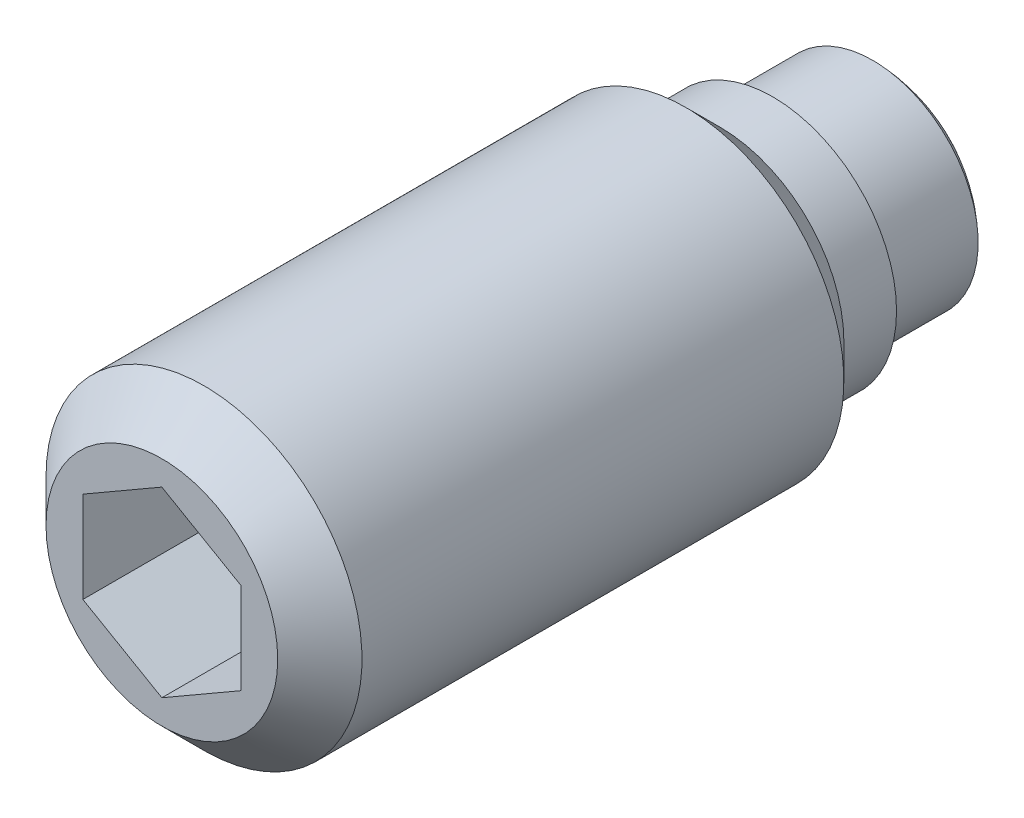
ISO-10303-21;
HEADER;
FILE_DESCRIPTION(('STEP AP214'),'2;1');
FILE_NAME('part.step','',(''),(''),'','','');
FILE_SCHEMA(('AUTOMOTIVE_DESIGN { 1 0 10303 214 1 1 1 1 }'));
ENDSEC;
DATA;
#1=APPLICATION_CONTEXT('core data for automotive mechanical design processes');
#2=APPLICATION_PROTOCOL_DEFINITION('international standard','automotive_design',2000,#1);
#3=PRODUCT_CONTEXT('',#1,'mechanical');
#4=PRODUCT('Part','Part','',(#3));
#5=PRODUCT_RELATED_PRODUCT_CATEGORY('part','',(#4));
#6=PRODUCT_DEFINITION_FORMATION('','',#4);
#7=PRODUCT_DEFINITION_CONTEXT('part definition',#1,'design');
#8=PRODUCT_DEFINITION('design','',#6,#7);
#9=PRODUCT_DEFINITION_SHAPE('','',#8);
#10=(LENGTH_UNIT() NAMED_UNIT(*) SI_UNIT(.MILLI.,.METRE.));
#11=(NAMED_UNIT(*) PLANE_ANGLE_UNIT() SI_UNIT($,.RADIAN.));
#12=(NAMED_UNIT(*) SI_UNIT($,.STERADIAN.) SOLID_ANGLE_UNIT());
#13=UNCERTAINTY_MEASURE_WITH_UNIT(LENGTH_MEASURE(1.E-05),#10,'distance_accuracy_value','');
#14=(GEOMETRIC_REPRESENTATION_CONTEXT(3) GLOBAL_UNCERTAINTY_ASSIGNED_CONTEXT((#13)) GLOBAL_UNIT_ASSIGNED_CONTEXT((#10,
#11,#12)) REPRESENTATION_CONTEXT('',''));
#15=CARTESIAN_POINT('',(0.,0.,0.));
#16=DIRECTION('',(0.,0.,1.));
#17=DIRECTION('',(1.,0.,0.));
#18=AXIS2_PLACEMENT_3D('',#15,#16,#17);
#19=CARTESIAN_POINT('',(0.,2.35,2.7));
#20=DIRECTION('',(0.,0.,1.));
#21=DIRECTION('',(1.,0.,0.));
#22=AXIS2_PLACEMENT_3D('',#19,#20,#21);
#23=PLANE('',#22);
#24=CARTESIAN_POINT('',(0.,0.,2.7));
#25=DIRECTION('',(0.,0.,-1.));
#26=DIRECTION('',(-1.,0.,0.));
#27=AXIS2_PLACEMENT_3D('',#24,#25,#26);
#28=CIRCLE('',#27,2.);
#29=CARTESIAN_POINT('',(-2.00000000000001,0.,2.7));
#30=VERTEX_POINT('',#29);
#31=EDGE_CURVE('E103',#30,#30,#28,.T.);
#32=ORIENTED_EDGE('',*,*,#31,.F.);
#33=EDGE_LOOP('',(#32));
#34=FACE_BOUND('',#33,.T.);
#35=CARTESIAN_POINT('',(0.,0.,2.7));
#36=DIRECTION('',(0.,0.,-1.));
#37=DIRECTION('',(-1.,0.,0.));
#38=AXIS2_PLACEMENT_3D('',#35,#36,#37);
#39=CIRCLE('',#38,2.35);
#40=CARTESIAN_POINT('',(-2.35000000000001,0.,2.7));
#41=VERTEX_POINT('',#40);
#42=EDGE_CURVE('E123',#41,#41,#39,.T.);
#43=ORIENTED_EDGE('',*,*,#42,.T.);
#44=EDGE_LOOP('',(#43));
#45=FACE_BOUND('',#44,.T.);
#46=ADVANCED_FACE('F14',(#34,#45),#23,.F.);
#47=CARTESIAN_POINT('',(0.,0.,14.3));
#48=DIRECTION('',(0.,0.,-1.));
#49=DIRECTION('',(-1.,0.,0.));
#50=AXIS2_PLACEMENT_3D('',#47,#48,#49);
#51=PLANE('',#50);
#52=CARTESIAN_POINT('',(0.,0.,14.3));
#53=DIRECTION('',(0.,0.,-1.));
#54=DIRECTION('',(-1.,0.,0.));
#55=AXIS2_PLACEMENT_3D('',#52,#53,#54);
#56=CIRCLE('',#55,2.2);
#57=CARTESIAN_POINT('',(-2.20000000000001,0.,14.3));
#58=VERTEX_POINT('',#57);
#59=EDGE_CURVE('E9',#58,#58,#56,.T.);
#60=ORIENTED_EDGE('',*,*,#59,.F.);
#61=EDGE_LOOP('',(#60));
#62=FACE_BOUND('',#61,.T.);
#63=DIRECTION('',(0.866025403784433,-0.500000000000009,0.));
#64=VECTOR('',#63,1.);
#65=CARTESIAN_POINT('',(0.,1.7320508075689,14.3));
#66=LINE('',#65,#64);
#67=CARTESIAN_POINT('',(0.,1.7320508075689,14.3));
#68=VERTEX_POINT('',#67);
#69=CARTESIAN_POINT('',(1.49999999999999,0.86602540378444,14.3));
#70=VERTEX_POINT('',#69);
#71=EDGE_CURVE('E29',#68,#70,#66,.T.);
#72=ORIENTED_EDGE('',*,*,#71,.T.);
#73=DIRECTION('',(0.,-1.,0.));
#74=VECTOR('',#73,1.);
#75=CARTESIAN_POINT('',(1.49999999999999,0.86602540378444,14.3));
#76=LINE('',#75,#74);
#77=CARTESIAN_POINT('',(1.49999999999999,-0.86602540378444,14.3));
#78=VERTEX_POINT('',#77);
#79=EDGE_CURVE('E102',#70,#78,#76,.T.);
#80=ORIENTED_EDGE('',*,*,#79,.T.);
#81=DIRECTION('',(-0.866025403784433,-0.500000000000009,0.));
#82=VECTOR('',#81,1.);
#83=CARTESIAN_POINT('',(1.49999999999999,-0.86602540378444,14.3));
#84=LINE('',#83,#82);
#85=CARTESIAN_POINT('',(0.,-1.7320508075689,14.3));
#86=VERTEX_POINT('',#85);
#87=EDGE_CURVE('E106',#78,#86,#84,.T.);
#88=ORIENTED_EDGE('',*,*,#87,.T.);
#89=DIRECTION('',(-0.866025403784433,0.500000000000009,0.));
#90=VECTOR('',#89,1.);
#91=CARTESIAN_POINT('',(0.,-1.7320508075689,14.3));
#92=LINE('',#91,#90);
#93=CARTESIAN_POINT('',(-1.5,-0.86602540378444,14.3));
#94=VERTEX_POINT('',#93);
#95=EDGE_CURVE('E109',#86,#94,#92,.T.);
#96=ORIENTED_EDGE('',*,*,#95,.T.);
#97=DIRECTION('',(0.,1.,0.));
#98=VECTOR('',#97,1.);
#99=CARTESIAN_POINT('',(-1.5,-0.86602540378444,14.3));
#100=LINE('',#99,#98);
#101=CARTESIAN_POINT('',(-1.5,0.86602540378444,14.3));
#102=VERTEX_POINT('',#101);
#103=EDGE_CURVE('E92',#94,#102,#100,.T.);
#104=ORIENTED_EDGE('',*,*,#103,.T.);
#105=DIRECTION('',(0.866025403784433,0.500000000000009,0.));
#106=VECTOR('',#105,1.);
#107=CARTESIAN_POINT('',(-1.5,0.86602540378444,14.3));
#108=LINE('',#107,#106);
#109=EDGE_CURVE('E112',#102,#68,#108,.T.);
#110=ORIENTED_EDGE('',*,*,#109,.T.);
#111=EDGE_LOOP('',(#72,#80,#88,#96,#104,#110));
#112=FACE_BOUND('',#111,.T.);
#113=ADVANCED_FACE('F16',(#62,#112),#51,.F.);
#114=CARTESIAN_POINT('',(0.,0.,14.3));
#115=DIRECTION('',(0.,0.,-1.));
#116=DIRECTION('',(-1.,0.,0.));
#117=AXIS2_PLACEMENT_3D('',#114,#115,#116);
#118=CONICAL_SURFACE('',#117,2.2,0.785398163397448);
#119=CARTESIAN_POINT('',(0.,0.,13.5));
#120=DIRECTION('',(0.,0.,-1.));
#121=DIRECTION('',(-1.,0.,0.));
#122=AXIS2_PLACEMENT_3D('',#119,#120,#121);
#123=CIRCLE('',#122,3.);
#124=CARTESIAN_POINT('',(-3.00000000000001,0.,13.5));
#125=VERTEX_POINT('',#124);
#126=EDGE_CURVE('E22',#125,#125,#123,.T.);
#127=ORIENTED_EDGE('',*,*,#126,.F.);
#128=EDGE_LOOP('',(#127));
#129=FACE_BOUND('',#128,.T.);
#130=ORIENTED_EDGE('',*,*,#59,.T.);
#131=EDGE_LOOP('',(#130));
#132=FACE_BOUND('',#131,.T.);
#133=ADVANCED_FACE('F136',(#129,#132),#118,.T.);
#134=CARTESIAN_POINT('',(0.,0.,2.7));
#135=DIRECTION('',(0.,0.,-1.));
#136=DIRECTION('',(-1.,0.,0.));
#137=AXIS2_PLACEMENT_3D('',#134,#135,#136);
#138=CYLINDRICAL_SURFACE('',#137,3.);
#139=CARTESIAN_POINT('',(0.,0.,4.35));
#140=DIRECTION('',(0.,0.,-1.));
#141=DIRECTION('',(-1.,0.,0.));
#142=AXIS2_PLACEMENT_3D('',#139,#140,#141);
#143=CIRCLE('',#142,3.);
#144=CARTESIAN_POINT('',(-3.00000000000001,0.,4.35));
#145=VERTEX_POINT('',#144);
#146=EDGE_CURVE('E129',#145,#145,#143,.T.);
#147=ORIENTED_EDGE('',*,*,#146,.F.);
#148=EDGE_LOOP('',(#147));
#149=FACE_BOUND('',#148,.T.);
#150=ORIENTED_EDGE('',*,*,#126,.T.);
#151=EDGE_LOOP('',(#150));
#152=FACE_BOUND('',#151,.T.);
#153=ADVANCED_FACE('F134',(#149,#152),#138,.T.);
#154=CARTESIAN_POINT('',(0.,0.,4.35));
#155=DIRECTION('',(0.,0.,1.));
#156=DIRECTION('',(1.,0.,0.));
#157=AXIS2_PLACEMENT_3D('',#154,#155,#156);
#158=CONICAL_SURFACE('',#157,3.,0.785398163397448);
#159=CARTESIAN_POINT('',(0.,0.,3.7));
#160=DIRECTION('',(0.,0.,-1.));
#161=DIRECTION('',(-1.,0.,0.));
#162=AXIS2_PLACEMENT_3D('',#159,#160,#161);
#163=CIRCLE('',#162,2.35);
#164=CARTESIAN_POINT('',(-2.35000000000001,0.,3.7));
#165=VERTEX_POINT('',#164);
#166=EDGE_CURVE('E126',#165,#165,#163,.T.);
#167=ORIENTED_EDGE('',*,*,#166,.F.);
#168=EDGE_LOOP('',(#167));
#169=FACE_BOUND('',#168,.T.);
#170=ORIENTED_EDGE('',*,*,#146,.T.);
#171=EDGE_LOOP('',(#170));
#172=FACE_BOUND('',#171,.T.);
#173=ADVANCED_FACE('F178',(#169,#172),#158,.T.);
#174=CARTESIAN_POINT('',(0.,0.,2.7));
#175=DIRECTION('',(0.,0.,-1.));
#176=DIRECTION('',(-1.,0.,0.));
#177=AXIS2_PLACEMENT_3D('',#174,#175,#176);
#178=CYLINDRICAL_SURFACE('',#177,2.35);
#179=ORIENTED_EDGE('',*,*,#42,.F.);
#180=EDGE_LOOP('',(#179));
#181=FACE_BOUND('',#180,.T.);
#182=ORIENTED_EDGE('',*,*,#166,.T.);
#183=EDGE_LOOP('',(#182));
#184=FACE_BOUND('',#183,.T.);
#185=ADVANCED_FACE('F165',(#181,#184),#178,.T.);
#186=CARTESIAN_POINT('',(0.,1.7320508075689,10.8));
#187=DIRECTION('',(-0.500000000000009,-0.866025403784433,0.));
#188=DIRECTION('',(-0.866025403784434,0.500000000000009,0.));
#189=AXIS2_PLACEMENT_3D('',#186,#187,#188);
#190=PLANE('',#189);
#191=ORIENTED_EDGE('',*,*,#71,.F.);
#192=DIRECTION('',(0.,0.,1.));
#193=VECTOR('',#192,1.);
#194=CARTESIAN_POINT('',(0.,1.7320508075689,10.8));
#195=LINE('',#194,#193);
#196=CARTESIAN_POINT('',(0.,1.7320508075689,10.8));
#197=VERTEX_POINT('',#196);
#198=EDGE_CURVE('E97',#197,#68,#195,.T.);
#199=ORIENTED_EDGE('',*,*,#198,.F.);
#200=DIRECTION('',(0.866025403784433,-0.500000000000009,0.));
#201=VECTOR('',#200,1.);
#202=CARTESIAN_POINT('',(0.,1.7320508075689,10.8));
#203=LINE('',#202,#201);
#204=CARTESIAN_POINT('',(1.49999999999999,0.86602540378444,10.8));
#205=VERTEX_POINT('',#204);
#206=EDGE_CURVE('E115',#197,#205,#203,.T.);
#207=ORIENTED_EDGE('',*,*,#206,.T.);
#208=DIRECTION('',(0.,0.,1.));
#209=VECTOR('',#208,1.);
#210=CARTESIAN_POINT('',(1.49999999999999,0.86602540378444,10.8));
#211=LINE('',#210,#209);
#212=EDGE_CURVE('E121',#205,#70,#211,.T.);
#213=ORIENTED_EDGE('',*,*,#212,.T.);
#214=EDGE_LOOP('',(#191,#199,#207,#213));
#215=FACE_BOUND('',#214,.T.);
#216=ADVANCED_FACE('F144',(#215),#190,.T.);
#217=CARTESIAN_POINT('',(1.49999999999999,0.86602540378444,10.8));
#218=DIRECTION('',(-1.,0.,0.));
#219=DIRECTION('',(0.,0.,1.));
#220=AXIS2_PLACEMENT_3D('',#217,#218,#219);
#221=PLANE('',#220);
#222=ORIENTED_EDGE('',*,*,#79,.F.);
#223=ORIENTED_EDGE('',*,*,#212,.F.);
#224=DIRECTION('',(0.,-1.,0.));
#225=VECTOR('',#224,1.);
#226=CARTESIAN_POINT('',(1.49999999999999,0.86602540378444,10.8));
#227=LINE('',#226,#225);
#228=CARTESIAN_POINT('',(1.49999999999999,-0.86602540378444,10.8));
#229=VERTEX_POINT('',#228);
#230=EDGE_CURVE('E69',#205,#229,#227,.T.);
#231=ORIENTED_EDGE('',*,*,#230,.T.);
#232=DIRECTION('',(0.,0.,1.));
#233=VECTOR('',#232,1.);
#234=CARTESIAN_POINT('',(1.49999999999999,-0.86602540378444,10.8));
#235=LINE('',#234,#233);
#236=EDGE_CURVE('E119',#229,#78,#235,.T.);
#237=ORIENTED_EDGE('',*,*,#236,.T.);
#238=EDGE_LOOP('',(#222,#223,#231,#237));
#239=FACE_BOUND('',#238,.T.);
#240=ADVANCED_FACE('F155',(#239),#221,.T.);
#241=CARTESIAN_POINT('',(1.49999999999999,-0.86602540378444,10.8));
#242=DIRECTION('',(-0.500000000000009,0.866025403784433,0.));
#243=DIRECTION('',(0.866025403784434,0.500000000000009,0.));
#244=AXIS2_PLACEMENT_3D('',#241,#242,#243);
#245=PLANE('',#244);
#246=ORIENTED_EDGE('',*,*,#87,.F.);
#247=ORIENTED_EDGE('',*,*,#236,.F.);
#248=DIRECTION('',(-0.866025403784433,-0.500000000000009,0.));
#249=VECTOR('',#248,1.);
#250=CARTESIAN_POINT('',(1.49999999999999,-0.86602540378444,10.8));
#251=LINE('',#250,#249);
#252=CARTESIAN_POINT('',(0.,-1.7320508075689,10.8));
#253=VERTEX_POINT('',#252);
#254=EDGE_CURVE('E88',#229,#253,#251,.T.);
#255=ORIENTED_EDGE('',*,*,#254,.T.);
#256=DIRECTION('',(0.,0.,1.));
#257=VECTOR('',#256,1.);
#258=CARTESIAN_POINT('',(0.,-1.7320508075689,10.8));
#259=LINE('',#258,#257);
#260=EDGE_CURVE('E85',#253,#86,#259,.T.);
#261=ORIENTED_EDGE('',*,*,#260,.T.);
#262=EDGE_LOOP('',(#246,#247,#255,#261));
#263=FACE_BOUND('',#262,.T.);
#264=ADVANCED_FACE('F153',(#263),#245,.T.);
#265=CARTESIAN_POINT('',(0.,-1.7320508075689,10.8));
#266=DIRECTION('',(0.500000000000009,0.866025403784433,0.));
#267=DIRECTION('',(0.866025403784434,-0.500000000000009,0.));
#268=AXIS2_PLACEMENT_3D('',#265,#266,#267);
#269=PLANE('',#268);
#270=ORIENTED_EDGE('',*,*,#95,.F.);
#271=ORIENTED_EDGE('',*,*,#260,.F.);
#272=DIRECTION('',(-0.866025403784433,0.500000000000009,0.));
#273=VECTOR('',#272,1.);
#274=CARTESIAN_POINT('',(0.,-1.7320508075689,10.8));
#275=LINE('',#274,#273);
#276=CARTESIAN_POINT('',(-1.5,-0.86602540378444,10.8));
#277=VERTEX_POINT('',#276);
#278=EDGE_CURVE('E80',#253,#277,#275,.T.);
#279=ORIENTED_EDGE('',*,*,#278,.T.);
#280=DIRECTION('',(0.,0.,1.));
#281=VECTOR('',#280,1.);
#282=CARTESIAN_POINT('',(-1.5,-0.86602540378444,10.8));
#283=LINE('',#282,#281);
#284=EDGE_CURVE('E84',#277,#94,#283,.T.);
#285=ORIENTED_EDGE('',*,*,#284,.T.);
#286=EDGE_LOOP('',(#270,#271,#279,#285));
#287=FACE_BOUND('',#286,.T.);
#288=ADVANCED_FACE('F83',(#287),#269,.T.);
#289=CARTESIAN_POINT('',(-1.5,-0.86602540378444,10.8));
#290=DIRECTION('',(1.,0.,0.));
#291=DIRECTION('',(0.,0.,-1.));
#292=AXIS2_PLACEMENT_3D('',#289,#290,#291);
#293=PLANE('',#292);
#294=ORIENTED_EDGE('',*,*,#103,.F.);
#295=ORIENTED_EDGE('',*,*,#284,.F.);
#296=DIRECTION('',(0.,1.,0.));
#297=VECTOR('',#296,1.);
#298=CARTESIAN_POINT('',(-1.5,-0.86602540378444,10.8));
#299=LINE('',#298,#297);
#300=CARTESIAN_POINT('',(-1.5,0.86602540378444,10.8));
#301=VERTEX_POINT('',#300);
#302=EDGE_CURVE('E87',#277,#301,#299,.T.);
#303=ORIENTED_EDGE('',*,*,#302,.T.);
#304=DIRECTION('',(0.,0.,1.));
#305=VECTOR('',#304,1.);
#306=CARTESIAN_POINT('',(-1.5,0.86602540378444,10.8));
#307=LINE('',#306,#305);
#308=EDGE_CURVE('E60',#301,#102,#307,.T.);
#309=ORIENTED_EDGE('',*,*,#308,.T.);
#310=EDGE_LOOP('',(#294,#295,#303,#309));
#311=FACE_BOUND('',#310,.T.);
#312=ADVANCED_FACE('F90',(#311),#293,.T.);
#313=CARTESIAN_POINT('',(-1.5,0.86602540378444,10.8));
#314=DIRECTION('',(0.500000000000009,-0.866025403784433,0.));
#315=DIRECTION('',(-0.866025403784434,-0.500000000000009,0.));
#316=AXIS2_PLACEMENT_3D('',#313,#314,#315);
#317=PLANE('',#316);
#318=ORIENTED_EDGE('',*,*,#109,.F.);
#319=ORIENTED_EDGE('',*,*,#308,.F.);
#320=DIRECTION('',(0.866025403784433,0.500000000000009,0.));
#321=VECTOR('',#320,1.);
#322=CARTESIAN_POINT('',(-1.5,0.86602540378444,10.8));
#323=LINE('',#322,#321);
#324=EDGE_CURVE('E37',#301,#197,#323,.T.);
#325=ORIENTED_EDGE('',*,*,#324,.T.);
#326=ORIENTED_EDGE('',*,*,#198,.T.);
#327=EDGE_LOOP('',(#318,#319,#325,#326));
#328=FACE_BOUND('',#327,.T.);
#329=ADVANCED_FACE('F143',(#328),#317,.T.);
#330=CARTESIAN_POINT('',(0.,0.,10.8));
#331=DIRECTION('',(0.,0.,-1.));
#332=DIRECTION('',(-1.,0.,0.));
#333=AXIS2_PLACEMENT_3D('',#330,#331,#332);
#334=PLANE('',#333);
#335=ORIENTED_EDGE('',*,*,#206,.F.);
#336=ORIENTED_EDGE('',*,*,#324,.F.);
#337=ORIENTED_EDGE('',*,*,#302,.F.);
#338=ORIENTED_EDGE('',*,*,#278,.F.);
#339=ORIENTED_EDGE('',*,*,#254,.F.);
#340=ORIENTED_EDGE('',*,*,#230,.F.);
#341=EDGE_LOOP('',(#335,#336,#337,#338,#339,#340));
#342=FACE_BOUND('',#341,.T.);
#343=ADVANCED_FACE('F95',(#342),#334,.F.);
#344=CARTESIAN_POINT('',(0.,0.,0.));
#345=DIRECTION('',(0.,0.,-1.));
#346=DIRECTION('',(-1.,0.,0.));
#347=AXIS2_PLACEMENT_3D('',#344,#345,#346);
#348=CYLINDRICAL_SURFACE('',#347,2.);
#349=CARTESIAN_POINT('',(0.,0.,0.8));
#350=DIRECTION('',(0.,0.,-1.));
#351=DIRECTION('',(-1.,0.,0.));
#352=AXIS2_PLACEMENT_3D('',#349,#350,#351);
#353=CIRCLE('',#352,2.);
#354=CARTESIAN_POINT('',(-2.00000000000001,0.,0.8));
#355=VERTEX_POINT('',#354);
#356=EDGE_CURVE('E297',#355,#355,#353,.T.);
#357=ORIENTED_EDGE('',*,*,#356,.F.);
#358=EDGE_LOOP('',(#357));
#359=FACE_BOUND('',#358,.T.);
#360=ORIENTED_EDGE('',*,*,#31,.T.);
#361=EDGE_LOOP('',(#360));
#362=FACE_BOUND('',#361,.T.);
#363=ADVANCED_FACE('F263',(#359,#362),#348,.T.);
#364=CARTESIAN_POINT('',(0.0398938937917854,0.,2.9997347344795));
#365=DIRECTION('',(0.,-1.,0.));
#366=DIRECTION('',(-1.,0.,0.));
#367=AXIS2_PLACEMENT_3D('',#364,#365,#366);
#368=CIRCLE('',#367,3.00000000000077);
#369=TRIMMED_CURVE('',#368,(PARAMETER_VALUE(-1.55749797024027)),
(PARAMETER_VALUE(1.55749797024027)),.T.,.PARAMETER.);
#370=CARTESIAN_POINT('',(0.,0.,2.9997347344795));
#371=DIRECTION('',(0.,0.,-1.));
#372=AXIS1_PLACEMENT('',#370,#371);
#373=SURFACE_OF_REVOLUTION('',#369,#372);
#374=ORIENTED_EDGE('',*,*,#356,.T.);
#375=EDGE_LOOP('',(#374));
#376=FACE_BOUND('',#375,.T.);
#377=CARTESIAN_POINT('',(0.,0.,0.));
#378=VERTEX_POINT('',#377);
#379=VERTEX_LOOP('',#378);
#380=FACE_BOUND('',#379,.T.);
#381=ADVANCED_FACE('F270',(#376,#380),#373,.T.);
#382=CLOSED_SHELL('',(#46,#113,#133,#153,#173,#185,#216,#240,#264,#288,#312,#329,#343,#363,#381));
#383=MANIFOLD_SOLID_BREP('B1',#382);
#384=ADVANCED_BREP_SHAPE_REPRESENTATION('',(#18,#383),#14);
#385=SHAPE_DEFINITION_REPRESENTATION(#9,#384);
ENDSEC;
END-ISO-10303-21;
